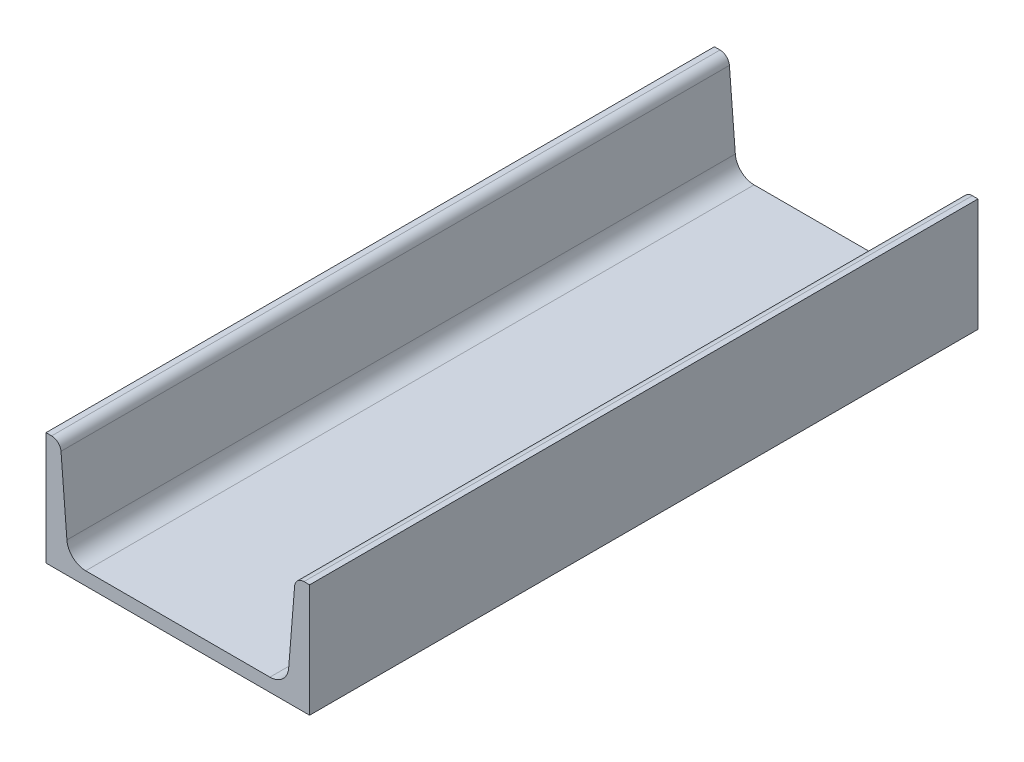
from build123d import *

# Parameters (mm, degrees)
BOSS_EXTRU_1_DEPTH = 355


with BuildPart() as part:
    # Esquisse1 → Boss.-Extru.1 (new body)
    with BuildSketch(Plane.XY.offset(177.5)):
        with BuildLine():
            Line((48.928051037, 7), (-48.928051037, 7))
            ThreePointArc((-48.928051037, 7), (-55.711320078, 9.652397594), (-58.896203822, 16.202547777))
            Line((-58.896203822, 16.202547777), (-62.031898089, 55.398726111))
            ThreePointArc((-62.031898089, 55.398726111), (-63.624339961, 58.673801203), (-67.015974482, 60))
            Line((-67.015974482, 60), (-70, 60))
            Line((-70, 60), (-70, 0))
            Line((-70, 0), (70, 0))
            Line((70, 0), (70, 60))
            Line((70, 60), (67.015974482, 60))
            ThreePointArc((67.015974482, 60), (63.624339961, 58.673801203), (62.031898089, 55.398726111))
            Line((62.031898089, 55.398726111), (58.896203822, 16.202547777))
            ThreePointArc((58.896203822, 16.202547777), (55.711320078, 9.652397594), (48.928051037, 7))
        make_face()
    extrude(amount=-BOSS_EXTRU_1_DEPTH)


solid = part.part
